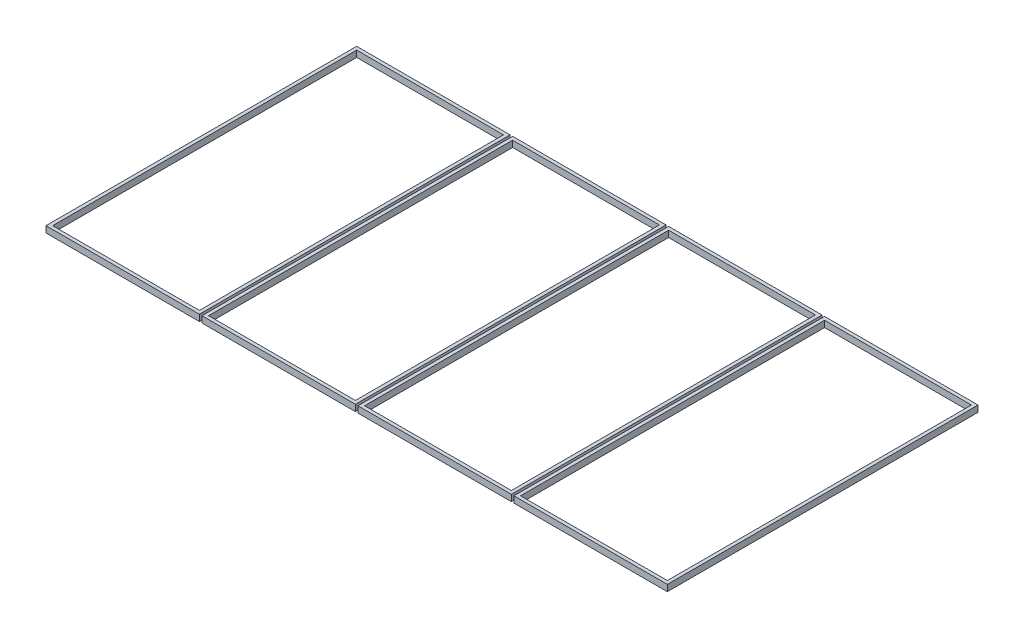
ISO-10303-21;
HEADER;
FILE_DESCRIPTION(('STEP AP214'),'2;1');
FILE_NAME('part.step','',(''),(''),'','','');
FILE_SCHEMA(('AUTOMOTIVE_DESIGN { 1 0 10303 214 1 1 1 1 }'));
ENDSEC;
DATA;
#1=APPLICATION_CONTEXT('core data for automotive mechanical design processes');
#2=APPLICATION_PROTOCOL_DEFINITION('international standard','automotive_design',2000,#1);
#3=PRODUCT_CONTEXT('',#1,'mechanical');
#4=PRODUCT('Part','Part','',(#3));
#5=PRODUCT_RELATED_PRODUCT_CATEGORY('part','',(#4));
#6=PRODUCT_DEFINITION_FORMATION('','',#4);
#7=PRODUCT_DEFINITION_CONTEXT('part definition',#1,'design');
#8=PRODUCT_DEFINITION('design','',#6,#7);
#9=PRODUCT_DEFINITION_SHAPE('','',#8);
#10=(LENGTH_UNIT() NAMED_UNIT(*) SI_UNIT(.MILLI.,.METRE.));
#11=(NAMED_UNIT(*) PLANE_ANGLE_UNIT() SI_UNIT($,.RADIAN.));
#12=(NAMED_UNIT(*) SI_UNIT($,.STERADIAN.) SOLID_ANGLE_UNIT());
#13=UNCERTAINTY_MEASURE_WITH_UNIT(LENGTH_MEASURE(1.E-05),#10,'distance_accuracy_value','');
#14=(GEOMETRIC_REPRESENTATION_CONTEXT(3) GLOBAL_UNCERTAINTY_ASSIGNED_CONTEXT((#13)) GLOBAL_UNIT_ASSIGNED_CONTEXT((#10,
#11,#12)) REPRESENTATION_CONTEXT('',''));
#15=CARTESIAN_POINT('',(0.,0.,0.));
#16=DIRECTION('',(0.,0.,1.));
#17=DIRECTION('',(1.,0.,0.));
#18=AXIS2_PLACEMENT_3D('',#15,#16,#17);
#19=CARTESIAN_POINT('',(0.,25.,0.));
#20=DIRECTION('',(0.,1.,0.));
#21=DIRECTION('',(0.,0.,1.));
#22=AXIS2_PLACEMENT_3D('',#19,#20,#21);
#23=PLANE('',#22);
#24=DIRECTION('',(1.,0.,0.));
#25=VECTOR('',#24,1.);
#26=CARTESIAN_POINT('',(1225.,25.,0.));
#27=LINE('',#26,#25);
#28=CARTESIAN_POINT('',(1225.,25.,0.));
#29=VERTEX_POINT('',#28);
#30=CARTESIAN_POINT('',(1827.5,25.,0.));
#31=VERTEX_POINT('',#30);
#32=EDGE_CURVE('E145',#29,#31,#27,.T.);
#33=ORIENTED_EDGE('',*,*,#32,.T.);
#34=DIRECTION('',(0.,0.,-1.));
#35=VECTOR('',#34,1.);
#36=CARTESIAN_POINT('',(1827.5,25.,0.));
#37=LINE('',#36,#35);
#38=CARTESIAN_POINT('',(1827.5,25.,-1220.));
#39=VERTEX_POINT('',#38);
#40=EDGE_CURVE('E147',#31,#39,#37,.T.);
#41=ORIENTED_EDGE('',*,*,#40,.T.);
#42=DIRECTION('',(-1.,0.,0.));
#43=VECTOR('',#42,1.);
#44=CARTESIAN_POINT('',(1225.,25.,-1220.));
#45=LINE('',#44,#43);
#46=CARTESIAN_POINT('',(1225.,25.,-1220.));
#47=VERTEX_POINT('',#46);
#48=EDGE_CURVE('E150',#39,#47,#45,.T.);
#49=ORIENTED_EDGE('',*,*,#48,.T.);
#50=DIRECTION('',(0.,0.,1.));
#51=VECTOR('',#50,1.);
#52=CARTESIAN_POINT('',(1225.,25.,0.));
#53=LINE('',#52,#51);
#54=EDGE_CURVE('E152',#47,#29,#53,.T.);
#55=ORIENTED_EDGE('',*,*,#54,.T.);
#56=EDGE_LOOP('',(#33,#41,#49,#55));
#57=FACE_BOUND('',#56,.T.);
#58=DIRECTION('',(1.,0.,0.));
#59=VECTOR('',#58,1.);
#60=CARTESIAN_POINT('',(1238.,25.,-13.));
#61=LINE('',#60,#59);
#62=CARTESIAN_POINT('',(1238.,25.,-13.));
#63=VERTEX_POINT('',#62);
#64=CARTESIAN_POINT('',(1814.5,25.,-13.));
#65=VERTEX_POINT('',#64);
#66=EDGE_CURVE('E117',#63,#65,#61,.T.);
#67=ORIENTED_EDGE('',*,*,#66,.F.);
#68=DIRECTION('',(0.,0.,1.));
#69=VECTOR('',#68,1.);
#70=CARTESIAN_POINT('',(1238.,25.,-13.));
#71=LINE('',#70,#69);
#72=CARTESIAN_POINT('',(1238.,25.,-1207.));
#73=VERTEX_POINT('',#72);
#74=EDGE_CURVE('E109',#73,#63,#71,.T.);
#75=ORIENTED_EDGE('',*,*,#74,.F.);
#76=DIRECTION('',(-1.,0.,0.));
#77=VECTOR('',#76,1.);
#78=CARTESIAN_POINT('',(1238.,25.,-1207.));
#79=LINE('',#78,#77);
#80=CARTESIAN_POINT('',(1814.5,25.,-1207.));
#81=VERTEX_POINT('',#80);
#82=EDGE_CURVE('E131',#81,#73,#79,.T.);
#83=ORIENTED_EDGE('',*,*,#82,.F.);
#84=DIRECTION('',(0.,0.,-1.));
#85=VECTOR('',#84,1.);
#86=CARTESIAN_POINT('',(1814.5,25.,-13.));
#87=LINE('',#86,#85);
#88=EDGE_CURVE('E129',#65,#81,#87,.T.);
#89=ORIENTED_EDGE('',*,*,#88,.F.);
#90=EDGE_LOOP('',(#67,#75,#83,#89));
#91=FACE_BOUND('',#90,.T.);
#92=ADVANCED_FACE('F44',(#57,#91),#23,.T.);
#93=CARTESIAN_POINT('',(0.,0.,0.));
#94=DIRECTION('',(0.,1.,0.));
#95=DIRECTION('',(0.,0.,1.));
#96=AXIS2_PLACEMENT_3D('',#93,#94,#95);
#97=PLANE('',#96);
#98=DIRECTION('',(1.,0.,0.));
#99=VECTOR('',#98,1.);
#100=CARTESIAN_POINT('',(1814.5,0.,0.));
#101=LINE('',#100,#99);
#102=CARTESIAN_POINT('',(1225.,0.,0.));
#103=VERTEX_POINT('',#102);
#104=CARTESIAN_POINT('',(1827.5,0.,0.));
#105=VERTEX_POINT('',#104);
#106=EDGE_CURVE('E125',#103,#105,#101,.T.);
#107=ORIENTED_EDGE('',*,*,#106,.F.);
#108=DIRECTION('',(0.,0.,1.));
#109=VECTOR('',#108,1.);
#110=CARTESIAN_POINT('',(1225.,0.,0.));
#111=LINE('',#110,#109);
#112=CARTESIAN_POINT('',(1225.,0.,-1220.));
#113=VERTEX_POINT('',#112);
#114=EDGE_CURVE('E148',#113,#103,#111,.T.);
#115=ORIENTED_EDGE('',*,*,#114,.F.);
#116=DIRECTION('',(-1.,0.,0.));
#117=VECTOR('',#116,1.);
#118=CARTESIAN_POINT('',(1225.,0.,-1220.));
#119=LINE('',#118,#117);
#120=CARTESIAN_POINT('',(1827.5,0.,-1220.));
#121=VERTEX_POINT('',#120);
#122=EDGE_CURVE('E158',#121,#113,#119,.T.);
#123=ORIENTED_EDGE('',*,*,#122,.F.);
#124=DIRECTION('',(0.,0.,-1.));
#125=VECTOR('',#124,1.);
#126=CARTESIAN_POINT('',(1827.5,0.,0.));
#127=LINE('',#126,#125);
#128=EDGE_CURVE('E156',#105,#121,#127,.T.);
#129=ORIENTED_EDGE('',*,*,#128,.F.);
#130=EDGE_LOOP('',(#107,#115,#123,#129));
#131=FACE_BOUND('',#130,.T.);
#132=DIRECTION('',(0.,0.,1.));
#133=VECTOR('',#132,1.);
#134=CARTESIAN_POINT('',(1238.,0.,-13.));
#135=LINE('',#134,#133);
#136=CARTESIAN_POINT('',(1238.,0.,-1207.));
#137=VERTEX_POINT('',#136);
#138=CARTESIAN_POINT('',(1238.,0.,-13.));
#139=VERTEX_POINT('',#138);
#140=EDGE_CURVE('E67',#137,#139,#135,.T.);
#141=ORIENTED_EDGE('',*,*,#140,.T.);
#142=DIRECTION('',(1.,0.,0.));
#143=VECTOR('',#142,1.);
#144=CARTESIAN_POINT('',(1238.,0.,-13.));
#145=LINE('',#144,#143);
#146=CARTESIAN_POINT('',(1814.5,0.,-13.));
#147=VERTEX_POINT('',#146);
#148=EDGE_CURVE('E124',#139,#147,#145,.T.);
#149=ORIENTED_EDGE('',*,*,#148,.T.);
#150=DIRECTION('',(0.,0.,-1.));
#151=VECTOR('',#150,1.);
#152=CARTESIAN_POINT('',(1814.5,0.,-13.));
#153=LINE('',#152,#151);
#154=CARTESIAN_POINT('',(1814.5,0.,-1207.));
#155=VERTEX_POINT('',#154);
#156=EDGE_CURVE('E137',#147,#155,#153,.T.);
#157=ORIENTED_EDGE('',*,*,#156,.T.);
#158=DIRECTION('',(-1.,0.,0.));
#159=VECTOR('',#158,1.);
#160=CARTESIAN_POINT('',(1238.,0.,-1207.));
#161=LINE('',#160,#159);
#162=EDGE_CURVE('E118',#155,#137,#161,.T.);
#163=ORIENTED_EDGE('',*,*,#162,.T.);
#164=EDGE_LOOP('',(#141,#149,#157,#163));
#165=FACE_BOUND('',#164,.T.);
#166=ADVANCED_FACE('F178',(#131,#165),#97,.F.);
#167=CARTESIAN_POINT('',(1814.5,25.,0.));
#168=DIRECTION('',(0.,0.,-1.));
#169=DIRECTION('',(-1.,0.,0.));
#170=AXIS2_PLACEMENT_3D('',#167,#168,#169);
#171=PLANE('',#170);
#172=ORIENTED_EDGE('',*,*,#106,.T.);
#173=DIRECTION('',(0.,-1.,0.));
#174=VECTOR('',#173,1.);
#175=CARTESIAN_POINT('',(1827.5,25.,0.));
#176=LINE('',#175,#174);
#177=EDGE_CURVE('E12',#31,#105,#176,.T.);
#178=ORIENTED_EDGE('',*,*,#177,.F.);
#179=ORIENTED_EDGE('',*,*,#32,.F.);
#180=DIRECTION('',(0.,-1.,0.));
#181=VECTOR('',#180,1.);
#182=CARTESIAN_POINT('',(1225.,25.,0.));
#183=LINE('',#182,#181);
#184=EDGE_CURVE('E154',#29,#103,#183,.T.);
#185=ORIENTED_EDGE('',*,*,#184,.T.);
#186=EDGE_LOOP('',(#172,#178,#179,#185));
#187=FACE_BOUND('',#186,.T.);
#188=ADVANCED_FACE('F46',(#187),#171,.F.);
#189=CARTESIAN_POINT('',(1827.5,25.,0.));
#190=DIRECTION('',(-1.,0.,0.));
#191=DIRECTION('',(0.,0.,1.));
#192=AXIS2_PLACEMENT_3D('',#189,#190,#191);
#193=PLANE('',#192);
#194=ORIENTED_EDGE('',*,*,#128,.T.);
#195=DIRECTION('',(0.,-1.,0.));
#196=VECTOR('',#195,1.);
#197=CARTESIAN_POINT('',(1827.5,25.,-1220.));
#198=LINE('',#197,#196);
#199=EDGE_CURVE('E52',#39,#121,#198,.T.);
#200=ORIENTED_EDGE('',*,*,#199,.F.);
#201=ORIENTED_EDGE('',*,*,#40,.F.);
#202=ORIENTED_EDGE('',*,*,#177,.T.);
#203=EDGE_LOOP('',(#194,#200,#201,#202));
#204=FACE_BOUND('',#203,.T.);
#205=ADVANCED_FACE('F188',(#204),#193,.F.);
#206=CARTESIAN_POINT('',(1225.,25.,-1220.));
#207=DIRECTION('',(0.,0.,1.));
#208=DIRECTION('',(1.,0.,0.));
#209=AXIS2_PLACEMENT_3D('',#206,#207,#208);
#210=PLANE('',#209);
#211=ORIENTED_EDGE('',*,*,#122,.T.);
#212=DIRECTION('',(0.,-1.,0.));
#213=VECTOR('',#212,1.);
#214=CARTESIAN_POINT('',(1225.,25.,-1220.));
#215=LINE('',#214,#213);
#216=EDGE_CURVE('E164',#47,#113,#215,.T.);
#217=ORIENTED_EDGE('',*,*,#216,.F.);
#218=ORIENTED_EDGE('',*,*,#48,.F.);
#219=ORIENTED_EDGE('',*,*,#199,.T.);
#220=EDGE_LOOP('',(#211,#217,#218,#219));
#221=FACE_BOUND('',#220,.T.);
#222=ADVANCED_FACE('F171',(#221),#210,.F.);
#223=CARTESIAN_POINT('',(1225.,25.,0.));
#224=DIRECTION('',(1.,0.,0.));
#225=DIRECTION('',(0.,0.,-1.));
#226=AXIS2_PLACEMENT_3D('',#223,#224,#225);
#227=PLANE('',#226);
#228=ORIENTED_EDGE('',*,*,#114,.T.);
#229=ORIENTED_EDGE('',*,*,#184,.F.);
#230=ORIENTED_EDGE('',*,*,#54,.F.);
#231=ORIENTED_EDGE('',*,*,#216,.T.);
#232=EDGE_LOOP('',(#228,#229,#230,#231));
#233=FACE_BOUND('',#232,.T.);
#234=ADVANCED_FACE('F182',(#233),#227,.F.);
#235=CARTESIAN_POINT('',(1238.,25.,-13.));
#236=DIRECTION('',(1.,0.,0.));
#237=DIRECTION('',(0.,0.,-1.));
#238=AXIS2_PLACEMENT_3D('',#235,#236,#237);
#239=PLANE('',#238);
#240=ORIENTED_EDGE('',*,*,#140,.F.);
#241=DIRECTION('',(0.,-1.,0.));
#242=VECTOR('',#241,1.);
#243=CARTESIAN_POINT('',(1238.,25.,-1207.));
#244=LINE('',#243,#242);
#245=EDGE_CURVE('E113',#73,#137,#244,.T.);
#246=ORIENTED_EDGE('',*,*,#245,.F.);
#247=ORIENTED_EDGE('',*,*,#74,.T.);
#248=DIRECTION('',(0.,-1.,0.));
#249=VECTOR('',#248,1.);
#250=CARTESIAN_POINT('',(1238.,25.,-13.));
#251=LINE('',#250,#249);
#252=EDGE_CURVE('E112',#63,#139,#251,.T.);
#253=ORIENTED_EDGE('',*,*,#252,.T.);
#254=EDGE_LOOP('',(#240,#246,#247,#253));
#255=FACE_BOUND('',#254,.T.);
#256=ADVANCED_FACE('F111',(#255),#239,.T.);
#257=CARTESIAN_POINT('',(1238.,25.,-13.));
#258=DIRECTION('',(0.,0.,-1.));
#259=DIRECTION('',(-1.,0.,0.));
#260=AXIS2_PLACEMENT_3D('',#257,#258,#259);
#261=PLANE('',#260);
#262=ORIENTED_EDGE('',*,*,#148,.F.);
#263=ORIENTED_EDGE('',*,*,#252,.F.);
#264=ORIENTED_EDGE('',*,*,#66,.T.);
#265=DIRECTION('',(0.,-1.,0.));
#266=VECTOR('',#265,1.);
#267=CARTESIAN_POINT('',(1814.5,25.,-13.));
#268=LINE('',#267,#266);
#269=EDGE_CURVE('E126',#65,#147,#268,.T.);
#270=ORIENTED_EDGE('',*,*,#269,.T.);
#271=EDGE_LOOP('',(#262,#263,#264,#270));
#272=FACE_BOUND('',#271,.T.);
#273=ADVANCED_FACE('F121',(#272),#261,.T.);
#274=CARTESIAN_POINT('',(1814.5,25.,-13.));
#275=DIRECTION('',(-1.,0.,0.));
#276=DIRECTION('',(0.,0.,1.));
#277=AXIS2_PLACEMENT_3D('',#274,#275,#276);
#278=PLANE('',#277);
#279=ORIENTED_EDGE('',*,*,#156,.F.);
#280=ORIENTED_EDGE('',*,*,#269,.F.);
#281=ORIENTED_EDGE('',*,*,#88,.T.);
#282=DIRECTION('',(0.,-1.,0.));
#283=VECTOR('',#282,1.);
#284=CARTESIAN_POINT('',(1814.5,25.,-1207.));
#285=LINE('',#284,#283);
#286=EDGE_CURVE('E59',#81,#155,#285,.T.);
#287=ORIENTED_EDGE('',*,*,#286,.T.);
#288=EDGE_LOOP('',(#279,#280,#281,#287));
#289=FACE_BOUND('',#288,.T.);
#290=ADVANCED_FACE('F211',(#289),#278,.T.);
#291=CARTESIAN_POINT('',(1238.,25.,-1207.));
#292=DIRECTION('',(0.,0.,1.));
#293=DIRECTION('',(1.,0.,0.));
#294=AXIS2_PLACEMENT_3D('',#291,#292,#293);
#295=PLANE('',#294);
#296=ORIENTED_EDGE('',*,*,#162,.F.);
#297=ORIENTED_EDGE('',*,*,#286,.F.);
#298=ORIENTED_EDGE('',*,*,#82,.T.);
#299=ORIENTED_EDGE('',*,*,#245,.T.);
#300=EDGE_LOOP('',(#296,#297,#298,#299));
#301=FACE_BOUND('',#300,.T.);
#302=ADVANCED_FACE('F215',(#301),#295,.T.);
#303=CLOSED_SHELL('',(#92,#166,#188,#205,#222,#234,#256,#273,#290,#302));
#304=MANIFOLD_SOLID_BREP('B2',#303);
#305=CARTESIAN_POINT('',(0.,25.,0.));
#306=DIRECTION('',(0.,1.,0.));
#307=DIRECTION('',(0.,0.,1.));
#308=AXIS2_PLACEMENT_3D('',#305,#306,#307);
#309=PLANE('',#308);
#310=DIRECTION('',(1.,0.,0.));
#311=VECTOR('',#310,1.);
#312=CARTESIAN_POINT('',(612.5,25.,0.));
#313=LINE('',#312,#311);
#314=CARTESIAN_POINT('',(612.5,25.,0.));
#315=VERTEX_POINT('',#314);
#316=CARTESIAN_POINT('',(1215.,25.,0.));
#317=VERTEX_POINT('',#316);
#318=EDGE_CURVE('E391',#315,#317,#313,.T.);
#319=ORIENTED_EDGE('',*,*,#318,.T.);
#320=DIRECTION('',(0.,0.,-1.));
#321=VECTOR('',#320,1.);
#322=CARTESIAN_POINT('',(1215.,25.,0.));
#323=LINE('',#322,#321);
#324=CARTESIAN_POINT('',(1215.,25.,-1220.));
#325=VERTEX_POINT('',#324);
#326=EDGE_CURVE('E393',#317,#325,#323,.T.);
#327=ORIENTED_EDGE('',*,*,#326,.T.);
#328=DIRECTION('',(-1.,0.,0.));
#329=VECTOR('',#328,1.);
#330=CARTESIAN_POINT('',(612.5,25.,-1220.));
#331=LINE('',#330,#329);
#332=CARTESIAN_POINT('',(612.5,25.,-1220.));
#333=VERTEX_POINT('',#332);
#334=EDGE_CURVE('E396',#325,#333,#331,.T.);
#335=ORIENTED_EDGE('',*,*,#334,.T.);
#336=DIRECTION('',(0.,0.,1.));
#337=VECTOR('',#336,1.);
#338=CARTESIAN_POINT('',(612.5,25.,0.));
#339=LINE('',#338,#337);
#340=EDGE_CURVE('E398',#333,#315,#339,.T.);
#341=ORIENTED_EDGE('',*,*,#340,.T.);
#342=EDGE_LOOP('',(#319,#327,#335,#341));
#343=FACE_BOUND('',#342,.T.);
#344=DIRECTION('',(1.,0.,0.));
#345=VECTOR('',#344,1.);
#346=CARTESIAN_POINT('',(625.5,25.,-13.));
#347=LINE('',#346,#345);
#348=CARTESIAN_POINT('',(625.5,25.,-13.));
#349=VERTEX_POINT('',#348);
#350=CARTESIAN_POINT('',(1202.,25.,-13.));
#351=VERTEX_POINT('',#350);
#352=EDGE_CURVE('E363',#349,#351,#347,.T.);
#353=ORIENTED_EDGE('',*,*,#352,.F.);
#354=DIRECTION('',(0.,0.,1.));
#355=VECTOR('',#354,1.);
#356=CARTESIAN_POINT('',(625.5,25.,-1207.));
#357=LINE('',#356,#355);
#358=CARTESIAN_POINT('',(625.5,25.,-1207.));
#359=VERTEX_POINT('',#358);
#360=EDGE_CURVE('E355',#359,#349,#357,.T.);
#361=ORIENTED_EDGE('',*,*,#360,.F.);
#362=DIRECTION('',(-1.,0.,0.));
#363=VECTOR('',#362,1.);
#364=CARTESIAN_POINT('',(625.5,25.,-1207.));
#365=LINE('',#364,#363);
#366=CARTESIAN_POINT('',(1202.,25.,-1207.));
#367=VERTEX_POINT('',#366);
#368=EDGE_CURVE('E377',#367,#359,#365,.T.);
#369=ORIENTED_EDGE('',*,*,#368,.F.);
#370=DIRECTION('',(0.,0.,-1.));
#371=VECTOR('',#370,1.);
#372=CARTESIAN_POINT('',(1202.,25.,-1207.));
#373=LINE('',#372,#371);
#374=EDGE_CURVE('E375',#351,#367,#373,.T.);
#375=ORIENTED_EDGE('',*,*,#374,.F.);
#376=EDGE_LOOP('',(#353,#361,#369,#375));
#377=FACE_BOUND('',#376,.T.);
#378=ADVANCED_FACE('F290',(#343,#377),#309,.T.);
#379=CARTESIAN_POINT('',(0.,0.,0.));
#380=DIRECTION('',(0.,1.,0.));
#381=DIRECTION('',(0.,0.,1.));
#382=AXIS2_PLACEMENT_3D('',#379,#380,#381);
#383=PLANE('',#382);
#384=DIRECTION('',(1.,0.,0.));
#385=VECTOR('',#384,1.);
#386=CARTESIAN_POINT('',(1202.,0.,0.));
#387=LINE('',#386,#385);
#388=CARTESIAN_POINT('',(612.5,0.,0.));
#389=VERTEX_POINT('',#388);
#390=CARTESIAN_POINT('',(1215.,0.,0.));
#391=VERTEX_POINT('',#390);
#392=EDGE_CURVE('E371',#389,#391,#387,.T.);
#393=ORIENTED_EDGE('',*,*,#392,.F.);
#394=DIRECTION('',(0.,0.,1.));
#395=VECTOR('',#394,1.);
#396=CARTESIAN_POINT('',(612.5,0.,0.));
#397=LINE('',#396,#395);
#398=CARTESIAN_POINT('',(612.5,0.,-1220.));
#399=VERTEX_POINT('',#398);
#400=EDGE_CURVE('E394',#399,#389,#397,.T.);
#401=ORIENTED_EDGE('',*,*,#400,.F.);
#402=DIRECTION('',(-1.,0.,0.));
#403=VECTOR('',#402,1.);
#404=CARTESIAN_POINT('',(612.5,0.,-1220.));
#405=LINE('',#404,#403);
#406=CARTESIAN_POINT('',(1215.,0.,-1220.));
#407=VERTEX_POINT('',#406);
#408=EDGE_CURVE('E404',#407,#399,#405,.T.);
#409=ORIENTED_EDGE('',*,*,#408,.F.);
#410=DIRECTION('',(0.,0.,-1.));
#411=VECTOR('',#410,1.);
#412=CARTESIAN_POINT('',(1215.,0.,0.));
#413=LINE('',#412,#411);
#414=EDGE_CURVE('E402',#391,#407,#413,.T.);
#415=ORIENTED_EDGE('',*,*,#414,.F.);
#416=EDGE_LOOP('',(#393,#401,#409,#415));
#417=FACE_BOUND('',#416,.T.);
#418=DIRECTION('',(0.,0.,1.));
#419=VECTOR('',#418,1.);
#420=CARTESIAN_POINT('',(625.5,0.,-1207.));
#421=LINE('',#420,#419);
#422=CARTESIAN_POINT('',(625.5,0.,-1207.));
#423=VERTEX_POINT('',#422);
#424=CARTESIAN_POINT('',(625.5,0.,-13.));
#425=VERTEX_POINT('',#424);
#426=EDGE_CURVE('E313',#423,#425,#421,.T.);
#427=ORIENTED_EDGE('',*,*,#426,.T.);
#428=DIRECTION('',(1.,0.,0.));
#429=VECTOR('',#428,1.);
#430=CARTESIAN_POINT('',(625.5,0.,-13.));
#431=LINE('',#430,#429);
#432=CARTESIAN_POINT('',(1202.,0.,-13.));
#433=VERTEX_POINT('',#432);
#434=EDGE_CURVE('E370',#425,#433,#431,.T.);
#435=ORIENTED_EDGE('',*,*,#434,.T.);
#436=DIRECTION('',(0.,0.,-1.));
#437=VECTOR('',#436,1.);
#438=CARTESIAN_POINT('',(1202.,0.,-1207.));
#439=LINE('',#438,#437);
#440=CARTESIAN_POINT('',(1202.,0.,-1207.));
#441=VERTEX_POINT('',#440);
#442=EDGE_CURVE('E383',#433,#441,#439,.T.);
#443=ORIENTED_EDGE('',*,*,#442,.T.);
#444=DIRECTION('',(-1.,0.,0.));
#445=VECTOR('',#444,1.);
#446=CARTESIAN_POINT('',(625.5,0.,-1207.));
#447=LINE('',#446,#445);
#448=EDGE_CURVE('E364',#441,#423,#447,.T.);
#449=ORIENTED_EDGE('',*,*,#448,.T.);
#450=EDGE_LOOP('',(#427,#435,#443,#449));
#451=FACE_BOUND('',#450,.T.);
#452=ADVANCED_FACE('F424',(#417,#451),#383,.F.);
#453=CARTESIAN_POINT('',(1202.,25.,0.));
#454=DIRECTION('',(0.,0.,-1.));
#455=DIRECTION('',(-1.,0.,0.));
#456=AXIS2_PLACEMENT_3D('',#453,#454,#455);
#457=PLANE('',#456);
#458=ORIENTED_EDGE('',*,*,#392,.T.);
#459=DIRECTION('',(0.,-1.,0.));
#460=VECTOR('',#459,1.);
#461=CARTESIAN_POINT('',(1215.,25.,0.));
#462=LINE('',#461,#460);
#463=EDGE_CURVE('E42',#317,#391,#462,.T.);
#464=ORIENTED_EDGE('',*,*,#463,.F.);
#465=ORIENTED_EDGE('',*,*,#318,.F.);
#466=DIRECTION('',(0.,-1.,0.));
#467=VECTOR('',#466,1.);
#468=CARTESIAN_POINT('',(612.5,25.,0.));
#469=LINE('',#468,#467);
#470=EDGE_CURVE('E400',#315,#389,#469,.T.);
#471=ORIENTED_EDGE('',*,*,#470,.T.);
#472=EDGE_LOOP('',(#458,#464,#465,#471));
#473=FACE_BOUND('',#472,.T.);
#474=ADVANCED_FACE('F292',(#473),#457,.F.);
#475=CARTESIAN_POINT('',(1215.,25.,0.));
#476=DIRECTION('',(-1.,0.,0.));
#477=DIRECTION('',(0.,0.,1.));
#478=AXIS2_PLACEMENT_3D('',#475,#476,#477);
#479=PLANE('',#478);
#480=ORIENTED_EDGE('',*,*,#414,.T.);
#481=DIRECTION('',(0.,-1.,0.));
#482=VECTOR('',#481,1.);
#483=CARTESIAN_POINT('',(1215.,25.,-1220.));
#484=LINE('',#483,#482);
#485=EDGE_CURVE('E298',#325,#407,#484,.T.);
#486=ORIENTED_EDGE('',*,*,#485,.F.);
#487=ORIENTED_EDGE('',*,*,#326,.F.);
#488=ORIENTED_EDGE('',*,*,#463,.T.);
#489=EDGE_LOOP('',(#480,#486,#487,#488));
#490=FACE_BOUND('',#489,.T.);
#491=ADVANCED_FACE('F434',(#490),#479,.F.);
#492=CARTESIAN_POINT('',(612.5,25.,-1220.));
#493=DIRECTION('',(0.,0.,1.));
#494=DIRECTION('',(1.,0.,0.));
#495=AXIS2_PLACEMENT_3D('',#492,#493,#494);
#496=PLANE('',#495);
#497=ORIENTED_EDGE('',*,*,#408,.T.);
#498=DIRECTION('',(0.,-1.,0.));
#499=VECTOR('',#498,1.);
#500=CARTESIAN_POINT('',(612.5,25.,-1220.));
#501=LINE('',#500,#499);
#502=EDGE_CURVE('E410',#333,#399,#501,.T.);
#503=ORIENTED_EDGE('',*,*,#502,.F.);
#504=ORIENTED_EDGE('',*,*,#334,.F.);
#505=ORIENTED_EDGE('',*,*,#485,.T.);
#506=EDGE_LOOP('',(#497,#503,#504,#505));
#507=FACE_BOUND('',#506,.T.);
#508=ADVANCED_FACE('F417',(#507),#496,.F.);
#509=CARTESIAN_POINT('',(612.5,25.,0.));
#510=DIRECTION('',(1.,0.,0.));
#511=DIRECTION('',(0.,0.,-1.));
#512=AXIS2_PLACEMENT_3D('',#509,#510,#511);
#513=PLANE('',#512);
#514=ORIENTED_EDGE('',*,*,#400,.T.);
#515=ORIENTED_EDGE('',*,*,#470,.F.);
#516=ORIENTED_EDGE('',*,*,#340,.F.);
#517=ORIENTED_EDGE('',*,*,#502,.T.);
#518=EDGE_LOOP('',(#514,#515,#516,#517));
#519=FACE_BOUND('',#518,.T.);
#520=ADVANCED_FACE('F428',(#519),#513,.F.);
#521=CARTESIAN_POINT('',(625.5,25.,-1207.));
#522=DIRECTION('',(1.,0.,0.));
#523=DIRECTION('',(0.,0.,-1.));
#524=AXIS2_PLACEMENT_3D('',#521,#522,#523);
#525=PLANE('',#524);
#526=ORIENTED_EDGE('',*,*,#426,.F.);
#527=DIRECTION('',(0.,-1.,0.));
#528=VECTOR('',#527,1.);
#529=CARTESIAN_POINT('',(625.5,25.,-1207.));
#530=LINE('',#529,#528);
#531=EDGE_CURVE('E359',#359,#423,#530,.T.);
#532=ORIENTED_EDGE('',*,*,#531,.F.);
#533=ORIENTED_EDGE('',*,*,#360,.T.);
#534=DIRECTION('',(0.,-1.,0.));
#535=VECTOR('',#534,1.);
#536=CARTESIAN_POINT('',(625.5,25.,-13.));
#537=LINE('',#536,#535);
#538=EDGE_CURVE('E358',#349,#425,#537,.T.);
#539=ORIENTED_EDGE('',*,*,#538,.T.);
#540=EDGE_LOOP('',(#526,#532,#533,#539));
#541=FACE_BOUND('',#540,.T.);
#542=ADVANCED_FACE('F357',(#541),#525,.T.);
#543=CARTESIAN_POINT('',(625.5,25.,-13.));
#544=DIRECTION('',(0.,0.,-1.));
#545=DIRECTION('',(-1.,0.,0.));
#546=AXIS2_PLACEMENT_3D('',#543,#544,#545);
#547=PLANE('',#546);
#548=ORIENTED_EDGE('',*,*,#434,.F.);
#549=ORIENTED_EDGE('',*,*,#538,.F.);
#550=ORIENTED_EDGE('',*,*,#352,.T.);
#551=DIRECTION('',(0.,-1.,0.));
#552=VECTOR('',#551,1.);
#553=CARTESIAN_POINT('',(1202.,25.,-13.));
#554=LINE('',#553,#552);
#555=EDGE_CURVE('E372',#351,#433,#554,.T.);
#556=ORIENTED_EDGE('',*,*,#555,.T.);
#557=EDGE_LOOP('',(#548,#549,#550,#556));
#558=FACE_BOUND('',#557,.T.);
#559=ADVANCED_FACE('F367',(#558),#547,.T.);
#560=CARTESIAN_POINT('',(1202.,25.,-1207.));
#561=DIRECTION('',(-1.,0.,0.));
#562=DIRECTION('',(0.,0.,1.));
#563=AXIS2_PLACEMENT_3D('',#560,#561,#562);
#564=PLANE('',#563);
#565=ORIENTED_EDGE('',*,*,#442,.F.);
#566=ORIENTED_EDGE('',*,*,#555,.F.);
#567=ORIENTED_EDGE('',*,*,#374,.T.);
#568=DIRECTION('',(0.,-1.,0.));
#569=VECTOR('',#568,1.);
#570=CARTESIAN_POINT('',(1202.,25.,-1207.));
#571=LINE('',#570,#569);
#572=EDGE_CURVE('E305',#367,#441,#571,.T.);
#573=ORIENTED_EDGE('',*,*,#572,.T.);
#574=EDGE_LOOP('',(#565,#566,#567,#573));
#575=FACE_BOUND('',#574,.T.);
#576=ADVANCED_FACE('F457',(#575),#564,.T.);
#577=CARTESIAN_POINT('',(625.5,25.,-1207.));
#578=DIRECTION('',(0.,0.,1.));
#579=DIRECTION('',(1.,0.,0.));
#580=AXIS2_PLACEMENT_3D('',#577,#578,#579);
#581=PLANE('',#580);
#582=ORIENTED_EDGE('',*,*,#448,.F.);
#583=ORIENTED_EDGE('',*,*,#572,.F.);
#584=ORIENTED_EDGE('',*,*,#368,.T.);
#585=ORIENTED_EDGE('',*,*,#531,.T.);
#586=EDGE_LOOP('',(#582,#583,#584,#585));
#587=FACE_BOUND('',#586,.T.);
#588=ADVANCED_FACE('F461',(#587),#581,.T.);
#589=CLOSED_SHELL('',(#378,#452,#474,#491,#508,#520,#542,#559,#576,#588));
#590=MANIFOLD_SOLID_BREP('B6',#589);
#591=CARTESIAN_POINT('',(0.,25.,0.));
#592=DIRECTION('',(0.,1.,0.));
#593=DIRECTION('',(0.,0.,1.));
#594=AXIS2_PLACEMENT_3D('',#591,#592,#593);
#595=PLANE('',#594);
#596=DIRECTION('',(-1.,0.,0.));
#597=VECTOR('',#596,1.);
#598=CARTESIAN_POINT('',(1837.5,25.,-1220.));
#599=LINE('',#598,#597);
#600=CARTESIAN_POINT('',(2440.,25.,-1220.));
#601=VERTEX_POINT('',#600);
#602=CARTESIAN_POINT('',(1837.5,25.,-1220.));
#603=VERTEX_POINT('',#602);
#604=EDGE_CURVE('E636',#601,#603,#599,.T.);
#605=ORIENTED_EDGE('',*,*,#604,.T.);
#606=DIRECTION('',(0.,0.,1.));
#607=VECTOR('',#606,1.);
#608=CARTESIAN_POINT('',(1837.5,25.,0.));
#609=LINE('',#608,#607);
#610=CARTESIAN_POINT('',(1837.5,25.,0.));
#611=VERTEX_POINT('',#610);
#612=EDGE_CURVE('E639',#603,#611,#609,.T.);
#613=ORIENTED_EDGE('',*,*,#612,.T.);
#614=DIRECTION('',(1.,0.,0.));
#615=VECTOR('',#614,1.);
#616=CARTESIAN_POINT('',(1837.5,25.,0.));
#617=LINE('',#616,#615);
#618=CARTESIAN_POINT('',(2440.,25.,0.));
#619=VERTEX_POINT('',#618);
#620=EDGE_CURVE('E642',#611,#619,#617,.T.);
#621=ORIENTED_EDGE('',*,*,#620,.T.);
#622=DIRECTION('',(0.,0.,-1.));
#623=VECTOR('',#622,1.);
#624=CARTESIAN_POINT('',(2440.,25.,0.));
#625=LINE('',#624,#623);
#626=EDGE_CURVE('E644',#619,#601,#625,.T.);
#627=ORIENTED_EDGE('',*,*,#626,.T.);
#628=EDGE_LOOP('',(#605,#613,#621,#627));
#629=FACE_BOUND('',#628,.T.);
#630=DIRECTION('',(1.,0.,0.));
#631=VECTOR('',#630,1.);
#632=CARTESIAN_POINT('',(1850.5,25.,-13.));
#633=LINE('',#632,#631);
#634=CARTESIAN_POINT('',(1850.5,25.,-13.));
#635=VERTEX_POINT('',#634);
#636=CARTESIAN_POINT('',(2427.,25.,-13.));
#637=VERTEX_POINT('',#636);
#638=EDGE_CURVE('E608',#635,#637,#633,.T.);
#639=ORIENTED_EDGE('',*,*,#638,.F.);
#640=DIRECTION('',(0.,0.,1.));
#641=VECTOR('',#640,1.);
#642=CARTESIAN_POINT('',(1850.5,25.,-1207.));
#643=LINE('',#642,#641);
#644=CARTESIAN_POINT('',(1850.5,25.,-1207.));
#645=VERTEX_POINT('',#644);
#646=EDGE_CURVE('E600',#645,#635,#643,.T.);
#647=ORIENTED_EDGE('',*,*,#646,.F.);
#648=DIRECTION('',(-1.,0.,0.));
#649=VECTOR('',#648,1.);
#650=CARTESIAN_POINT('',(1850.5,25.,-1207.));
#651=LINE('',#650,#649);
#652=CARTESIAN_POINT('',(2427.,25.,-1207.));
#653=VERTEX_POINT('',#652);
#654=EDGE_CURVE('E622',#653,#645,#651,.T.);
#655=ORIENTED_EDGE('',*,*,#654,.F.);
#656=DIRECTION('',(0.,0.,-1.));
#657=VECTOR('',#656,1.);
#658=CARTESIAN_POINT('',(2427.,25.,-1207.));
#659=LINE('',#658,#657);
#660=EDGE_CURVE('E620',#637,#653,#659,.T.);
#661=ORIENTED_EDGE('',*,*,#660,.F.);
#662=EDGE_LOOP('',(#639,#647,#655,#661));
#663=FACE_BOUND('',#662,.T.);
#664=ADVANCED_FACE('F535',(#629,#663),#595,.T.);
#665=CARTESIAN_POINT('',(0.,0.,0.));
#666=DIRECTION('',(0.,1.,0.));
#667=DIRECTION('',(0.,0.,1.));
#668=AXIS2_PLACEMENT_3D('',#665,#666,#667);
#669=PLANE('',#668);
#670=DIRECTION('',(-1.,0.,0.));
#671=VECTOR('',#670,1.);
#672=CARTESIAN_POINT('',(1837.5,0.,-1220.));
#673=LINE('',#672,#671);
#674=CARTESIAN_POINT('',(2440.,0.,-1220.));
#675=VERTEX_POINT('',#674);
#676=CARTESIAN_POINT('',(1837.5,0.,-1220.));
#677=VERTEX_POINT('',#676);
#678=EDGE_CURVE('E616',#675,#677,#673,.T.);
#679=ORIENTED_EDGE('',*,*,#678,.F.);
#680=DIRECTION('',(0.,0.,-1.));
#681=VECTOR('',#680,1.);
#682=CARTESIAN_POINT('',(2440.,0.,0.));
#683=LINE('',#682,#681);
#684=CARTESIAN_POINT('',(2440.,0.,0.));
#685=VERTEX_POINT('',#684);
#686=EDGE_CURVE('E640',#685,#675,#683,.T.);
#687=ORIENTED_EDGE('',*,*,#686,.F.);
#688=DIRECTION('',(1.,0.,0.));
#689=VECTOR('',#688,1.);
#690=CARTESIAN_POINT('',(2427.,0.,0.));
#691=LINE('',#690,#689);
#692=CARTESIAN_POINT('',(1837.5,0.,0.));
#693=VERTEX_POINT('',#692);
#694=EDGE_CURVE('E652',#693,#685,#691,.T.);
#695=ORIENTED_EDGE('',*,*,#694,.F.);
#696=DIRECTION('',(0.,0.,1.));
#697=VECTOR('',#696,1.);
#698=CARTESIAN_POINT('',(1837.5,0.,0.));
#699=LINE('',#698,#697);
#700=EDGE_CURVE('E649',#677,#693,#699,.T.);
#701=ORIENTED_EDGE('',*,*,#700,.F.);
#702=EDGE_LOOP('',(#679,#687,#695,#701));
#703=FACE_BOUND('',#702,.T.);
#704=DIRECTION('',(0.,0.,1.));
#705=VECTOR('',#704,1.);
#706=CARTESIAN_POINT('',(1850.5,0.,-1207.));
#707=LINE('',#706,#705);
#708=CARTESIAN_POINT('',(1850.5,0.,-1207.));
#709=VERTEX_POINT('',#708);
#710=CARTESIAN_POINT('',(1850.5,0.,-13.));
#711=VERTEX_POINT('',#710);
#712=EDGE_CURVE('E558',#709,#711,#707,.T.);
#713=ORIENTED_EDGE('',*,*,#712,.T.);
#714=DIRECTION('',(1.,0.,0.));
#715=VECTOR('',#714,1.);
#716=CARTESIAN_POINT('',(1850.5,0.,-13.));
#717=LINE('',#716,#715);
#718=CARTESIAN_POINT('',(2427.,0.,-13.));
#719=VERTEX_POINT('',#718);
#720=EDGE_CURVE('E615',#711,#719,#717,.T.);
#721=ORIENTED_EDGE('',*,*,#720,.T.);
#722=DIRECTION('',(0.,0.,-1.));
#723=VECTOR('',#722,1.);
#724=CARTESIAN_POINT('',(2427.,0.,-1207.));
#725=LINE('',#724,#723);
#726=CARTESIAN_POINT('',(2427.,0.,-1207.));
#727=VERTEX_POINT('',#726);
#728=EDGE_CURVE('E628',#719,#727,#725,.T.);
#729=ORIENTED_EDGE('',*,*,#728,.T.);
#730=DIRECTION('',(-1.,0.,0.));
#731=VECTOR('',#730,1.);
#732=CARTESIAN_POINT('',(1850.5,0.,-1207.));
#733=LINE('',#732,#731);
#734=EDGE_CURVE('E609',#727,#709,#733,.T.);
#735=ORIENTED_EDGE('',*,*,#734,.T.);
#736=EDGE_LOOP('',(#713,#721,#729,#735));
#737=FACE_BOUND('',#736,.T.);
#738=ADVANCED_FACE('F670',(#703,#737),#669,.F.);
#739=CARTESIAN_POINT('',(1837.5,25.,-1220.));
#740=DIRECTION('',(0.,0.,1.));
#741=DIRECTION('',(1.,0.,0.));
#742=AXIS2_PLACEMENT_3D('',#739,#740,#741);
#743=PLANE('',#742);
#744=ORIENTED_EDGE('',*,*,#678,.T.);
#745=DIRECTION('',(0.,-1.,0.));
#746=VECTOR('',#745,1.);
#747=CARTESIAN_POINT('',(1837.5,25.,-1220.));
#748=LINE('',#747,#746);
#749=EDGE_CURVE('E288',#603,#677,#748,.T.);
#750=ORIENTED_EDGE('',*,*,#749,.F.);
#751=ORIENTED_EDGE('',*,*,#604,.F.);
#752=DIRECTION('',(0.,-1.,0.));
#753=VECTOR('',#752,1.);
#754=CARTESIAN_POINT('',(2440.,25.,-1220.));
#755=LINE('',#754,#753);
#756=EDGE_CURVE('E646',#601,#675,#755,.T.);
#757=ORIENTED_EDGE('',*,*,#756,.T.);
#758=EDGE_LOOP('',(#744,#750,#751,#757));
#759=FACE_BOUND('',#758,.T.);
#760=ADVANCED_FACE('F537',(#759),#743,.F.);
#761=CARTESIAN_POINT('',(1837.5,25.,0.));
#762=DIRECTION('',(1.,0.,0.));
#763=DIRECTION('',(0.,0.,-1.));
#764=AXIS2_PLACEMENT_3D('',#761,#762,#763);
#765=PLANE('',#764);
#766=ORIENTED_EDGE('',*,*,#700,.T.);
#767=DIRECTION('',(0.,-1.,0.));
#768=VECTOR('',#767,1.);
#769=CARTESIAN_POINT('',(1837.5,25.,0.));
#770=LINE('',#769,#768);
#771=EDGE_CURVE('E543',#611,#693,#770,.T.);
#772=ORIENTED_EDGE('',*,*,#771,.F.);
#773=ORIENTED_EDGE('',*,*,#612,.F.);
#774=ORIENTED_EDGE('',*,*,#749,.T.);
#775=EDGE_LOOP('',(#766,#772,#773,#774));
#776=FACE_BOUND('',#775,.T.);
#777=ADVANCED_FACE('F666',(#776),#765,.F.);
#778=CARTESIAN_POINT('',(2427.,25.,0.));
#779=DIRECTION('',(0.,0.,-1.));
#780=DIRECTION('',(-1.,0.,0.));
#781=AXIS2_PLACEMENT_3D('',#778,#779,#780);
#782=PLANE('',#781);
#783=ORIENTED_EDGE('',*,*,#694,.T.);
#784=DIRECTION('',(0.,-1.,0.));
#785=VECTOR('',#784,1.);
#786=CARTESIAN_POINT('',(2440.,25.,0.));
#787=LINE('',#786,#785);
#788=EDGE_CURVE('E657',#619,#685,#787,.T.);
#789=ORIENTED_EDGE('',*,*,#788,.F.);
#790=ORIENTED_EDGE('',*,*,#620,.F.);
#791=ORIENTED_EDGE('',*,*,#771,.T.);
#792=EDGE_LOOP('',(#783,#789,#790,#791));
#793=FACE_BOUND('',#792,.T.);
#794=ADVANCED_FACE('F663',(#793),#782,.F.);
#795=CARTESIAN_POINT('',(2440.,25.,0.));
#796=DIRECTION('',(-1.,0.,0.));
#797=DIRECTION('',(0.,0.,1.));
#798=AXIS2_PLACEMENT_3D('',#795,#796,#797);
#799=PLANE('',#798);
#800=ORIENTED_EDGE('',*,*,#686,.T.);
#801=ORIENTED_EDGE('',*,*,#756,.F.);
#802=ORIENTED_EDGE('',*,*,#626,.F.);
#803=ORIENTED_EDGE('',*,*,#788,.T.);
#804=EDGE_LOOP('',(#800,#801,#802,#803));
#805=FACE_BOUND('',#804,.T.);
#806=ADVANCED_FACE('F675',(#805),#799,.F.);
#807=CARTESIAN_POINT('',(1850.5,25.,-1207.));
#808=DIRECTION('',(1.,0.,0.));
#809=DIRECTION('',(0.,0.,-1.));
#810=AXIS2_PLACEMENT_3D('',#807,#808,#809);
#811=PLANE('',#810);
#812=ORIENTED_EDGE('',*,*,#712,.F.);
#813=DIRECTION('',(0.,-1.,0.));
#814=VECTOR('',#813,1.);
#815=CARTESIAN_POINT('',(1850.5,25.,-1207.));
#816=LINE('',#815,#814);
#817=EDGE_CURVE('E604',#645,#709,#816,.T.);
#818=ORIENTED_EDGE('',*,*,#817,.F.);
#819=ORIENTED_EDGE('',*,*,#646,.T.);
#820=DIRECTION('',(0.,-1.,0.));
#821=VECTOR('',#820,1.);
#822=CARTESIAN_POINT('',(1850.5,25.,-13.));
#823=LINE('',#822,#821);
#824=EDGE_CURVE('E603',#635,#711,#823,.T.);
#825=ORIENTED_EDGE('',*,*,#824,.T.);
#826=EDGE_LOOP('',(#812,#818,#819,#825));
#827=FACE_BOUND('',#826,.T.);
#828=ADVANCED_FACE('F602',(#827),#811,.T.);
#829=CARTESIAN_POINT('',(1850.5,25.,-13.));
#830=DIRECTION('',(0.,0.,-1.));
#831=DIRECTION('',(-1.,0.,0.));
#832=AXIS2_PLACEMENT_3D('',#829,#830,#831);
#833=PLANE('',#832);
#834=ORIENTED_EDGE('',*,*,#720,.F.);
#835=ORIENTED_EDGE('',*,*,#824,.F.);
#836=ORIENTED_EDGE('',*,*,#638,.T.);
#837=DIRECTION('',(0.,-1.,0.));
#838=VECTOR('',#837,1.);
#839=CARTESIAN_POINT('',(2427.,25.,-13.));
#840=LINE('',#839,#838);
#841=EDGE_CURVE('E617',#637,#719,#840,.T.);
#842=ORIENTED_EDGE('',*,*,#841,.T.);
#843=EDGE_LOOP('',(#834,#835,#836,#842));
#844=FACE_BOUND('',#843,.T.);
#845=ADVANCED_FACE('F612',(#844),#833,.T.);
#846=CARTESIAN_POINT('',(2427.,25.,-1207.));
#847=DIRECTION('',(-1.,0.,0.));
#848=DIRECTION('',(0.,0.,1.));
#849=AXIS2_PLACEMENT_3D('',#846,#847,#848);
#850=PLANE('',#849);
#851=ORIENTED_EDGE('',*,*,#728,.F.);
#852=ORIENTED_EDGE('',*,*,#841,.F.);
#853=ORIENTED_EDGE('',*,*,#660,.T.);
#854=DIRECTION('',(0.,-1.,0.));
#855=VECTOR('',#854,1.);
#856=CARTESIAN_POINT('',(2427.,25.,-1207.));
#857=LINE('',#856,#855);
#858=EDGE_CURVE('E550',#653,#727,#857,.T.);
#859=ORIENTED_EDGE('',*,*,#858,.T.);
#860=EDGE_LOOP('',(#851,#852,#853,#859));
#861=FACE_BOUND('',#860,.T.);
#862=ADVANCED_FACE('F744',(#861),#850,.T.);
#863=CARTESIAN_POINT('',(1850.5,25.,-1207.));
#864=DIRECTION('',(0.,0.,1.));
#865=DIRECTION('',(1.,0.,0.));
#866=AXIS2_PLACEMENT_3D('',#863,#864,#865);
#867=PLANE('',#866);
#868=ORIENTED_EDGE('',*,*,#734,.F.);
#869=ORIENTED_EDGE('',*,*,#858,.F.);
#870=ORIENTED_EDGE('',*,*,#654,.T.);
#871=ORIENTED_EDGE('',*,*,#817,.T.);
#872=EDGE_LOOP('',(#868,#869,#870,#871));
#873=FACE_BOUND('',#872,.T.);
#874=ADVANCED_FACE('F751',(#873),#867,.T.);
#875=CLOSED_SHELL('',(#664,#738,#760,#777,#794,#806,#828,#845,#862,#874));
#876=MANIFOLD_SOLID_BREP('B36',#875);
#877=CARTESIAN_POINT('',(0.,25.,0.));
#878=DIRECTION('',(0.,1.,0.));
#879=DIRECTION('',(0.,0.,1.));
#880=AXIS2_PLACEMENT_3D('',#877,#878,#879);
#881=PLANE('',#880);
#882=DIRECTION('',(1.,0.,0.));
#883=VECTOR('',#882,1.);
#884=CARTESIAN_POINT('',(0.,25.,0.));
#885=LINE('',#884,#883);
#886=CARTESIAN_POINT('',(0.,25.,0.));
#887=VERTEX_POINT('',#886);
#888=CARTESIAN_POINT('',(602.5,25.,0.));
#889=VERTEX_POINT('',#888);
#890=EDGE_CURVE('E872',#887,#889,#885,.T.);
#891=ORIENTED_EDGE('',*,*,#890,.T.);
#892=DIRECTION('',(0.,0.,-1.));
#893=VECTOR('',#892,1.);
#894=CARTESIAN_POINT('',(602.5,25.,0.));
#895=LINE('',#894,#893);
#896=CARTESIAN_POINT('',(602.5,25.,-1220.));
#897=VERTEX_POINT('',#896);
#898=EDGE_CURVE('E874',#889,#897,#895,.T.);
#899=ORIENTED_EDGE('',*,*,#898,.T.);
#900=DIRECTION('',(-1.,0.,0.));
#901=VECTOR('',#900,1.);
#902=CARTESIAN_POINT('',(0.,25.,-1220.));
#903=LINE('',#902,#901);
#904=CARTESIAN_POINT('',(0.,25.,-1220.));
#905=VERTEX_POINT('',#904);
#906=EDGE_CURVE('E877',#897,#905,#903,.T.);
#907=ORIENTED_EDGE('',*,*,#906,.T.);
#908=DIRECTION('',(0.,0.,1.));
#909=VECTOR('',#908,1.);
#910=CARTESIAN_POINT('',(0.,25.,0.));
#911=LINE('',#910,#909);
#912=EDGE_CURVE('E879',#905,#887,#911,.T.);
#913=ORIENTED_EDGE('',*,*,#912,.T.);
#914=EDGE_LOOP('',(#891,#899,#907,#913));
#915=FACE_BOUND('',#914,.T.);
#916=DIRECTION('',(1.,0.,0.));
#917=VECTOR('',#916,1.);
#918=CARTESIAN_POINT('',(12.9999999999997,25.,-12.9999999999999));
#919=LINE('',#918,#917);
#920=CARTESIAN_POINT('',(12.9999999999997,25.,-12.9999999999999));
#921=VERTEX_POINT('',#920);
#922=CARTESIAN_POINT('',(589.5,25.,-12.9999999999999));
#923=VERTEX_POINT('',#922);
#924=EDGE_CURVE('E844',#921,#923,#919,.T.);
#925=ORIENTED_EDGE('',*,*,#924,.F.);
#926=DIRECTION('',(0.,0.,1.));
#927=VECTOR('',#926,1.);
#928=CARTESIAN_POINT('',(12.9999999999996,25.,-1207.));
#929=LINE('',#928,#927);
#930=CARTESIAN_POINT('',(12.9999999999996,25.,-1207.));
#931=VERTEX_POINT('',#930);
#932=EDGE_CURVE('E836',#931,#921,#929,.T.);
#933=ORIENTED_EDGE('',*,*,#932,.F.);
#934=DIRECTION('',(-1.,0.,0.));
#935=VECTOR('',#934,1.);
#936=CARTESIAN_POINT('',(12.9999999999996,25.,-1207.));
#937=LINE('',#936,#935);
#938=CARTESIAN_POINT('',(589.5,25.,-1207.));
#939=VERTEX_POINT('',#938);
#940=EDGE_CURVE('E858',#939,#931,#937,.T.);
#941=ORIENTED_EDGE('',*,*,#940,.F.);
#942=DIRECTION('',(0.,0.,-1.));
#943=VECTOR('',#942,1.);
#944=CARTESIAN_POINT('',(589.5,25.,-1207.));
#945=LINE('',#944,#943);
#946=EDGE_CURVE('E856',#923,#939,#945,.T.);
#947=ORIENTED_EDGE('',*,*,#946,.F.);
#948=EDGE_LOOP('',(#925,#933,#941,#947));
#949=FACE_BOUND('',#948,.T.);
#950=ADVANCED_FACE('F771',(#915,#949),#881,.T.);
#951=CARTESIAN_POINT('',(0.,0.,0.));
#952=DIRECTION('',(0.,1.,0.));
#953=DIRECTION('',(0.,0.,1.));
#954=AXIS2_PLACEMENT_3D('',#951,#952,#953);
#955=PLANE('',#954);
#956=DIRECTION('',(1.,0.,0.));
#957=VECTOR('',#956,1.);
#958=CARTESIAN_POINT('',(589.5,0.,0.));
#959=LINE('',#958,#957);
#960=CARTESIAN_POINT('',(0.,0.,0.));
#961=VERTEX_POINT('',#960);
#962=CARTESIAN_POINT('',(602.5,0.,0.));
#963=VERTEX_POINT('',#962);
#964=EDGE_CURVE('E852',#961,#963,#959,.T.);
#965=ORIENTED_EDGE('',*,*,#964,.F.);
#966=DIRECTION('',(0.,0.,1.));
#967=VECTOR('',#966,1.);
#968=CARTESIAN_POINT('',(0.,0.,0.));
#969=LINE('',#968,#967);
#970=CARTESIAN_POINT('',(0.,0.,-1220.));
#971=VERTEX_POINT('',#970);
#972=EDGE_CURVE('E875',#971,#961,#969,.T.);
#973=ORIENTED_EDGE('',*,*,#972,.F.);
#974=DIRECTION('',(-1.,0.,0.));
#975=VECTOR('',#974,1.);
#976=CARTESIAN_POINT('',(0.,0.,-1220.));
#977=LINE('',#976,#975);
#978=CARTESIAN_POINT('',(602.5,0.,-1220.));
#979=VERTEX_POINT('',#978);
#980=EDGE_CURVE('E885',#979,#971,#977,.T.);
#981=ORIENTED_EDGE('',*,*,#980,.F.);
#982=DIRECTION('',(0.,0.,-1.));
#983=VECTOR('',#982,1.);
#984=CARTESIAN_POINT('',(602.5,0.,0.));
#985=LINE('',#984,#983);
#986=EDGE_CURVE('E883',#963,#979,#985,.T.);
#987=ORIENTED_EDGE('',*,*,#986,.F.);
#988=EDGE_LOOP('',(#965,#973,#981,#987));
#989=FACE_BOUND('',#988,.T.);
#990=DIRECTION('',(0.,0.,1.));
#991=VECTOR('',#990,1.);
#992=CARTESIAN_POINT('',(12.9999999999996,0.,-1207.));
#993=LINE('',#992,#991);
#994=CARTESIAN_POINT('',(12.9999999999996,0.,-1207.));
#995=VERTEX_POINT('',#994);
#996=CARTESIAN_POINT('',(12.9999999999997,0.,-12.9999999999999));
#997=VERTEX_POINT('',#996);
#998=EDGE_CURVE('E794',#995,#997,#993,.T.);
#999=ORIENTED_EDGE('',*,*,#998,.T.);
#1000=DIRECTION('',(1.,0.,0.));
#1001=VECTOR('',#1000,1.);
#1002=CARTESIAN_POINT('',(12.9999999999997,0.,-12.9999999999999));
#1003=LINE('',#1002,#1001);
#1004=CARTESIAN_POINT('',(589.5,0.,-12.9999999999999));
#1005=VERTEX_POINT('',#1004);
#1006=EDGE_CURVE('E851',#997,#1005,#1003,.T.);
#1007=ORIENTED_EDGE('',*,*,#1006,.T.);
#1008=DIRECTION('',(0.,0.,-1.));
#1009=VECTOR('',#1008,1.);
#1010=CARTESIAN_POINT('',(589.5,0.,-1207.));
#1011=LINE('',#1010,#1009);
#1012=CARTESIAN_POINT('',(589.5,0.,-1207.));
#1013=VERTEX_POINT('',#1012);
#1014=EDGE_CURVE('E864',#1005,#1013,#1011,.T.);
#1015=ORIENTED_EDGE('',*,*,#1014,.T.);
#1016=DIRECTION('',(-1.,0.,0.));
#1017=VECTOR('',#1016,1.);
#1018=CARTESIAN_POINT('',(12.9999999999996,0.,-1207.));
#1019=LINE('',#1018,#1017);
#1020=EDGE_CURVE('E845',#1013,#995,#1019,.T.);
#1021=ORIENTED_EDGE('',*,*,#1020,.T.);
#1022=EDGE_LOOP('',(#999,#1007,#1015,#1021));
#1023=FACE_BOUND('',#1022,.T.);
#1024=ADVANCED_FACE('F905',(#989,#1023),#955,.F.);
#1025=CARTESIAN_POINT('',(589.5,25.,0.));
#1026=DIRECTION('',(0.,0.,-1.));
#1027=DIRECTION('',(-1.,0.,0.));
#1028=AXIS2_PLACEMENT_3D('',#1025,#1026,#1027);
#1029=PLANE('',#1028);
#1030=ORIENTED_EDGE('',*,*,#964,.T.);
#1031=DIRECTION('',(0.,-1.,0.));
#1032=VECTOR('',#1031,1.);
#1033=CARTESIAN_POINT('',(602.5,25.,0.));
#1034=LINE('',#1033,#1032);
#1035=EDGE_CURVE('E533',#889,#963,#1034,.T.);
#1036=ORIENTED_EDGE('',*,*,#1035,.F.);
#1037=ORIENTED_EDGE('',*,*,#890,.F.);
#1038=DIRECTION('',(0.,-1.,0.));
#1039=VECTOR('',#1038,1.);
#1040=CARTESIAN_POINT('',(0.,25.,0.));
#1041=LINE('',#1040,#1039);
#1042=EDGE_CURVE('E881',#887,#961,#1041,.T.);
#1043=ORIENTED_EDGE('',*,*,#1042,.T.);
#1044=EDGE_LOOP('',(#1030,#1036,#1037,#1043));
#1045=FACE_BOUND('',#1044,.T.);
#1046=ADVANCED_FACE('F773',(#1045),#1029,.F.);
#1047=CARTESIAN_POINT('',(602.5,25.,0.));
#1048=DIRECTION('',(-1.,0.,0.));
#1049=DIRECTION('',(0.,0.,1.));
#1050=AXIS2_PLACEMENT_3D('',#1047,#1048,#1049);
#1051=PLANE('',#1050);
#1052=ORIENTED_EDGE('',*,*,#986,.T.);
#1053=DIRECTION('',(0.,-1.,0.));
#1054=VECTOR('',#1053,1.);
#1055=CARTESIAN_POINT('',(602.5,25.,-1220.));
#1056=LINE('',#1055,#1054);
#1057=EDGE_CURVE('E779',#897,#979,#1056,.T.);
#1058=ORIENTED_EDGE('',*,*,#1057,.F.);
#1059=ORIENTED_EDGE('',*,*,#898,.F.);
#1060=ORIENTED_EDGE('',*,*,#1035,.T.);
#1061=EDGE_LOOP('',(#1052,#1058,#1059,#1060));
#1062=FACE_BOUND('',#1061,.T.);
#1063=ADVANCED_FACE('F915',(#1062),#1051,.F.);
#1064=CARTESIAN_POINT('',(0.,25.,-1220.));
#1065=DIRECTION('',(0.,0.,1.));
#1066=DIRECTION('',(1.,0.,0.));
#1067=AXIS2_PLACEMENT_3D('',#1064,#1065,#1066);
#1068=PLANE('',#1067);
#1069=ORIENTED_EDGE('',*,*,#980,.T.);
#1070=DIRECTION('',(0.,-1.,0.));
#1071=VECTOR('',#1070,1.);
#1072=CARTESIAN_POINT('',(0.,25.,-1220.));
#1073=LINE('',#1072,#1071);
#1074=EDGE_CURVE('E891',#905,#971,#1073,.T.);
#1075=ORIENTED_EDGE('',*,*,#1074,.F.);
#1076=ORIENTED_EDGE('',*,*,#906,.F.);
#1077=ORIENTED_EDGE('',*,*,#1057,.T.);
#1078=EDGE_LOOP('',(#1069,#1075,#1076,#1077));
#1079=FACE_BOUND('',#1078,.T.);
#1080=ADVANCED_FACE('F898',(#1079),#1068,.F.);
#1081=CARTESIAN_POINT('',(0.,25.,0.));
#1082=DIRECTION('',(1.,0.,0.));
#1083=DIRECTION('',(0.,0.,-1.));
#1084=AXIS2_PLACEMENT_3D('',#1081,#1082,#1083);
#1085=PLANE('',#1084);
#1086=ORIENTED_EDGE('',*,*,#972,.T.);
#1087=ORIENTED_EDGE('',*,*,#1042,.F.);
#1088=ORIENTED_EDGE('',*,*,#912,.F.);
#1089=ORIENTED_EDGE('',*,*,#1074,.T.);
#1090=EDGE_LOOP('',(#1086,#1087,#1088,#1089));
#1091=FACE_BOUND('',#1090,.T.);
#1092=ADVANCED_FACE('F909',(#1091),#1085,.F.);
#1093=CARTESIAN_POINT('',(12.9999999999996,25.,-1207.));
#1094=DIRECTION('',(1.,0.,0.));
#1095=DIRECTION('',(0.,0.,-1.));
#1096=AXIS2_PLACEMENT_3D('',#1093,#1094,#1095);
#1097=PLANE('',#1096);
#1098=ORIENTED_EDGE('',*,*,#998,.F.);
#1099=DIRECTION('',(0.,-1.,0.));
#1100=VECTOR('',#1099,1.);
#1101=CARTESIAN_POINT('',(12.9999999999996,25.,-1207.));
#1102=LINE('',#1101,#1100);
#1103=EDGE_CURVE('E840',#931,#995,#1102,.T.);
#1104=ORIENTED_EDGE('',*,*,#1103,.F.);
#1105=ORIENTED_EDGE('',*,*,#932,.T.);
#1106=DIRECTION('',(0.,-1.,0.));
#1107=VECTOR('',#1106,1.);
#1108=CARTESIAN_POINT('',(12.9999999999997,25.,-12.9999999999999));
#1109=LINE('',#1108,#1107);
#1110=EDGE_CURVE('E839',#921,#997,#1109,.T.);
#1111=ORIENTED_EDGE('',*,*,#1110,.T.);
#1112=EDGE_LOOP('',(#1098,#1104,#1105,#1111));
#1113=FACE_BOUND('',#1112,.T.);
#1114=ADVANCED_FACE('F838',(#1113),#1097,.T.);
#1115=CARTESIAN_POINT('',(12.9999999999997,25.,-12.9999999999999));
#1116=DIRECTION('',(0.,0.,-1.));
#1117=DIRECTION('',(-1.,0.,0.));
#1118=AXIS2_PLACEMENT_3D('',#1115,#1116,#1117);
#1119=PLANE('',#1118);
#1120=ORIENTED_EDGE('',*,*,#1006,.F.);
#1121=ORIENTED_EDGE('',*,*,#1110,.F.);
#1122=ORIENTED_EDGE('',*,*,#924,.T.);
#1123=DIRECTION('',(0.,-1.,0.));
#1124=VECTOR('',#1123,1.);
#1125=CARTESIAN_POINT('',(589.5,25.,-12.9999999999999));
#1126=LINE('',#1125,#1124);
#1127=EDGE_CURVE('E853',#923,#1005,#1126,.T.);
#1128=ORIENTED_EDGE('',*,*,#1127,.T.);
#1129=EDGE_LOOP('',(#1120,#1121,#1122,#1128));
#1130=FACE_BOUND('',#1129,.T.);
#1131=ADVANCED_FACE('F848',(#1130),#1119,.T.);
#1132=CARTESIAN_POINT('',(589.5,25.,-1207.));
#1133=DIRECTION('',(-1.,0.,0.));
#1134=DIRECTION('',(0.,0.,1.));
#1135=AXIS2_PLACEMENT_3D('',#1132,#1133,#1134);
#1136=PLANE('',#1135);
#1137=ORIENTED_EDGE('',*,*,#1014,.F.);
#1138=ORIENTED_EDGE('',*,*,#1127,.F.);
#1139=ORIENTED_EDGE('',*,*,#946,.T.);
#1140=DIRECTION('',(0.,-1.,0.));
#1141=VECTOR('',#1140,1.);
#1142=CARTESIAN_POINT('',(589.5,25.,-1207.));
#1143=LINE('',#1142,#1141);
#1144=EDGE_CURVE('E786',#939,#1013,#1143,.T.);
#1145=ORIENTED_EDGE('',*,*,#1144,.T.);
#1146=EDGE_LOOP('',(#1137,#1138,#1139,#1145));
#1147=FACE_BOUND('',#1146,.T.);
#1148=ADVANCED_FACE('F938',(#1147),#1136,.T.);
#1149=CARTESIAN_POINT('',(12.9999999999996,25.,-1207.));
#1150=DIRECTION('',(0.,0.,1.));
#1151=DIRECTION('',(1.,0.,0.));
#1152=AXIS2_PLACEMENT_3D('',#1149,#1150,#1151);
#1153=PLANE('',#1152);
#1154=ORIENTED_EDGE('',*,*,#1020,.F.);
#1155=ORIENTED_EDGE('',*,*,#1144,.F.);
#1156=ORIENTED_EDGE('',*,*,#940,.T.);
#1157=ORIENTED_EDGE('',*,*,#1103,.T.);
#1158=EDGE_LOOP('',(#1154,#1155,#1156,#1157));
#1159=FACE_BOUND('',#1158,.T.);
#1160=ADVANCED_FACE('F942',(#1159),#1153,.T.);
#1161=CLOSED_SHELL('',(#950,#1024,#1046,#1063,#1080,#1092,#1114,#1131,#1148,#1160));
#1162=MANIFOLD_SOLID_BREP('B282',#1161);
#1163=ADVANCED_BREP_SHAPE_REPRESENTATION('',(#18,#304,#590,#876,#1162),#14);
#1164=SHAPE_DEFINITION_REPRESENTATION(#9,#1163);
ENDSEC;
END-ISO-10303-21;
